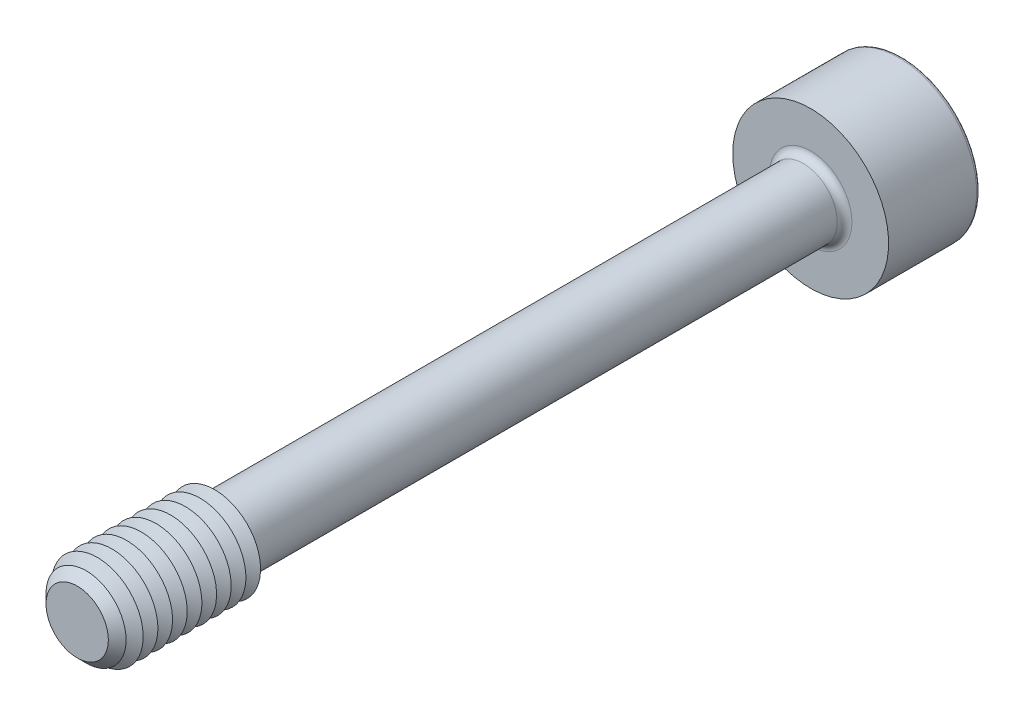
from build123d import *

# Parameters (mm, degrees)
SKETCH1_R       = 1.85
EXTRUDE1_DEPTH  = 20
CHAMFER1_SIZE   = 0.8
SKETCH3_R       = 4.25
EXTRUDE2_DEPTH  = 5
EXTRUDE3_DEPTH  = 4
FILLET1_R       = 0.4
FILLET2_R       = 0.2
LPATTERN1_COUNT = 9
LPATTERN1_PITCH = 0.8


with BuildPart() as part:
    # Sketch1 → Extrude1 (new, symmetric)
    with BuildSketch(Plane.XY):
        Circle(SKETCH1_R)
    extrude(amount=EXTRUDE1_DEPTH, both=True)

    # Sketch2 → Revolve1 (revolve)
    with BuildSketch(Plane(origin=(0, 0, 0), x_dir=(0, 0, -1), z_dir=(1, 0, 0))):
        Polygon((-20, 0), (-20, 2.5), (-12.5, 2.5), (-12.124722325, 1.85), (-12.124722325, 0), align=None)
    revolve(axis=Axis((0, 0, 12.124722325), (0, 0, 1)))

    # Chamfer1
    chamfer1_edges = [part.edges().sort_by_distance(p)[0] for p in [
        (0, -2.5, 20),
    ]]
    chamfer(chamfer1_edges, length=CHAMFER1_SIZE)

    # Sketch3 → Extrude2 (add)
    with BuildSketch(Plane(origin=(0, 0, -20), x_dir=(-1, 0, 0), z_dir=(0, 0, -1))):
        Circle(SKETCH3_R)
    extrude(amount=EXTRUDE2_DEPTH)

    # Sketch4 → Extrude3 (cut)
    with BuildSketch(Plane(origin=(-13.7, 0, -25), x_dir=(1, 0, 0), z_dir=(0, 0, 1))):
        Polygon((12.545299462, -2), (14.854700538, -2), (16.009401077, 0), (14.854700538, 2), (12.545299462, 2), (11.390598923, 0), align=None)
    extrude(amount=EXTRUDE3_DEPTH, mode=Mode.SUBTRACT)

    # Fillet1
    fillet1_edges = [part.edges().sort_by_distance(p)[0] for p in [
        (-1.85, 0, -20),
    ]]
    fillet(fillet1_edges, radius=FILLET1_R)

    # Fillet2
    fillet2_edges = [part.edges().sort_by_distance(p)[0] for p in [
        (4.25, 0, -25),
    ]]
    fillet(fillet2_edges, radius=FILLET2_R)

    # Sketch5 → Cut-Revolve1 (revolve, cut)
    with BuildSketch(Plane(origin=(0, 0, 0), x_dir=(0, 0, -1), z_dir=(1, 0, 0)), mode=Mode.PRIVATE) as cut_revolve1_sk:
        Polygon((21, 0), (21, -2), (19.845299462, 0), align=None)
    revolve(cut_revolve1_sk.sketch.rotate(Axis((0, 0, -19.845299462), (0, 0, -1)), 90), axis=Axis((0, 0, -19.845299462), (0, 0, -1)), mode=Mode.SUBTRACT)

    # Sketch7 → Cut-Revolve2 (revolve, cut)
    with BuildSketch(Plane(origin=(0, 0, 0), x_dir=(0, 0, -1), z_dir=(1, 0, 0)), mode=Mode.PRIVATE) as cut_revolve2_sk:
        Polygon((-12.5, 2.5), (-12.9, 1.807179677), (-13.3, 2.5), align=None)
    cut_revolve2 = revolve(cut_revolve2_sk.sketch.rotate(Axis((0, 0, -1.332048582), (0, 0, 1)), 90), axis=Axis((0, 0, -1.332048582), (0, 0, 1)), mode=Mode.SUBTRACT)

    # LPattern1: Cut-Revolve2 ×9
    with Locations(*[(0, 0, i * LPATTERN1_PITCH) for i in range(1, LPATTERN1_COUNT)]):
        add(cut_revolve2, mode=Mode.SUBTRACT)


solid = part.part
